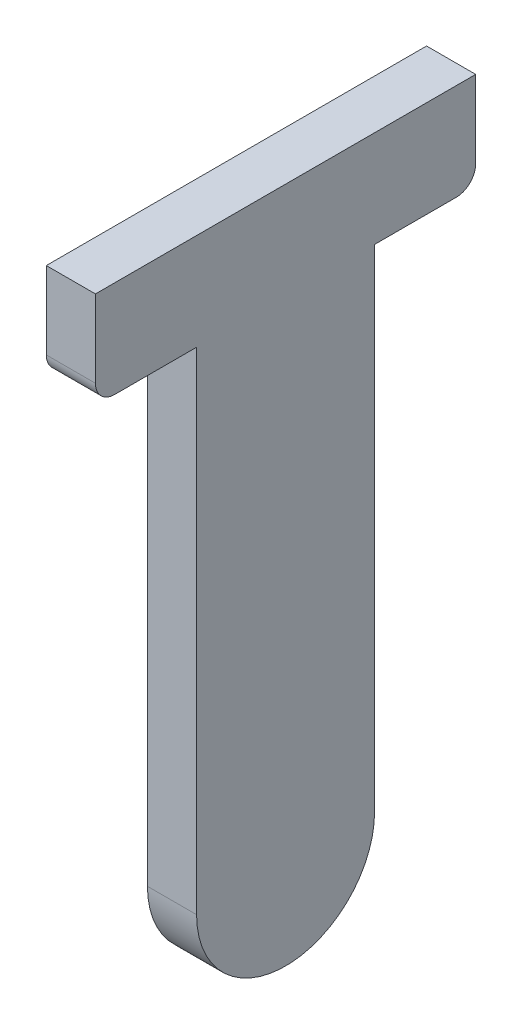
ISO-10303-21;
HEADER;
FILE_DESCRIPTION(('STEP AP214'),'2;1');
FILE_NAME('part.step','',(''),(''),'','','');
FILE_SCHEMA(('AUTOMOTIVE_DESIGN { 1 0 10303 214 1 1 1 1 }'));
ENDSEC;
DATA;
#1=APPLICATION_CONTEXT('core data for automotive mechanical design processes');
#2=APPLICATION_PROTOCOL_DEFINITION('international standard','automotive_design',2000,#1);
#3=PRODUCT_CONTEXT('',#1,'mechanical');
#4=PRODUCT('Part','Part','',(#3));
#5=PRODUCT_RELATED_PRODUCT_CATEGORY('part','',(#4));
#6=PRODUCT_DEFINITION_FORMATION('','',#4);
#7=PRODUCT_DEFINITION_CONTEXT('part definition',#1,'design');
#8=PRODUCT_DEFINITION('design','',#6,#7);
#9=PRODUCT_DEFINITION_SHAPE('','',#8);
#10=(LENGTH_UNIT() NAMED_UNIT(*) SI_UNIT(.MILLI.,.METRE.));
#11=(NAMED_UNIT(*) PLANE_ANGLE_UNIT() SI_UNIT($,.RADIAN.));
#12=(NAMED_UNIT(*) SI_UNIT($,.STERADIAN.) SOLID_ANGLE_UNIT());
#13=UNCERTAINTY_MEASURE_WITH_UNIT(LENGTH_MEASURE(1.E-05),#10,'distance_accuracy_value','');
#14=(GEOMETRIC_REPRESENTATION_CONTEXT(3) GLOBAL_UNCERTAINTY_ASSIGNED_CONTEXT((#13)) GLOBAL_UNIT_ASSIGNED_CONTEXT((#10,
#11,#12)) REPRESENTATION_CONTEXT('',''));
#15=CARTESIAN_POINT('',(0.,0.,0.));
#16=DIRECTION('',(0.,0.,1.));
#17=DIRECTION('',(1.,0.,0.));
#18=AXIS2_PLACEMENT_3D('',#15,#16,#17);
#19=CARTESIAN_POINT('',(-6.996,-9.21,0.));
#20=DIRECTION('',(1.,0.,0.));
#21=DIRECTION('',(0.,0.,-1.));
#22=AXIS2_PLACEMENT_3D('',#19,#20,#21);
#23=PLANE('',#22);
#24=CARTESIAN_POINT('',(-6.996,-9.61,-22.38274));
#25=DIRECTION('',(1.,0.,0.));
#26=DIRECTION('',(0.,0.,-1.));
#27=AXIS2_PLACEMENT_3D('',#24,#25,#26);
#28=CIRCLE('',#27,0.1);
#29=CARTESIAN_POINT('',(-6.996,-9.61,-22.48274));
#30=VERTEX_POINT('',#29);
#31=CARTESIAN_POINT('',(-6.996,-9.71,-22.38274));
#32=VERTEX_POINT('',#31);
#33=EDGE_CURVE('E19',#30,#32,#28,.F.);
#34=ORIENTED_EDGE('',*,*,#33,.F.);
#35=DIRECTION('',(0.,1.,0.));
#36=VECTOR('',#35,1.);
#37=CARTESIAN_POINT('',(-6.996,-9.21,-22.48274));
#38=LINE('',#37,#36);
#39=CARTESIAN_POINT('',(-6.996,-9.21,-22.48274));
#40=VERTEX_POINT('',#39);
#41=EDGE_CURVE('E90',#30,#40,#38,.T.);
#42=ORIENTED_EDGE('',*,*,#41,.T.);
#43=DIRECTION('',(0.,0.,1.));
#44=VECTOR('',#43,1.);
#45=CARTESIAN_POINT('',(-6.996,-9.21,-20.51726));
#46=LINE('',#45,#44);
#47=CARTESIAN_POINT('',(-6.996,-9.21,-20.51726));
#48=VERTEX_POINT('',#47);
#49=EDGE_CURVE('E111',#48,#40,#46,.F.);
#50=ORIENTED_EDGE('',*,*,#49,.F.);
#51=DIRECTION('',(0.,1.,0.));
#52=VECTOR('',#51,1.);
#53=CARTESIAN_POINT('',(-6.996,-9.61,-20.51726));
#54=LINE('',#53,#52);
#55=CARTESIAN_POINT('',(-6.996,-9.61,-20.51726));
#56=VERTEX_POINT('',#55);
#57=EDGE_CURVE('E127',#56,#48,#54,.T.);
#58=ORIENTED_EDGE('',*,*,#57,.F.);
#59=CARTESIAN_POINT('',(-6.996,-9.61,-20.61726));
#60=DIRECTION('',(1.,0.,0.));
#61=DIRECTION('',(0.,0.,-1.));
#62=AXIS2_PLACEMENT_3D('',#59,#60,#61);
#63=CIRCLE('',#62,0.1);
#64=CARTESIAN_POINT('',(-6.996,-9.71,-20.61726));
#65=VERTEX_POINT('',#64);
#66=EDGE_CURVE('E133',#65,#56,#63,.F.);
#67=ORIENTED_EDGE('',*,*,#66,.F.);
#68=DIRECTION('',(0.,0.,-1.));
#69=VECTOR('',#68,1.);
#70=CARTESIAN_POINT('',(-6.996,-9.71,-21.04));
#71=LINE('',#70,#69);
#72=CARTESIAN_POINT('',(-6.996,-9.71,-21.04));
#73=VERTEX_POINT('',#72);
#74=EDGE_CURVE('E137',#73,#65,#71,.F.);
#75=ORIENTED_EDGE('',*,*,#74,.F.);
#76=DIRECTION('',(0.,1.,0.));
#77=VECTOR('',#76,1.);
#78=CARTESIAN_POINT('',(-6.996,-12.25,-21.04));
#79=LINE('',#78,#77);
#80=CARTESIAN_POINT('',(-6.996,-12.25,-21.04));
#81=VERTEX_POINT('',#80);
#82=EDGE_CURVE('E141',#81,#73,#79,.T.);
#83=ORIENTED_EDGE('',*,*,#82,.F.);
#84=CARTESIAN_POINT('',(-6.996,-12.25,-21.5));
#85=DIRECTION('',(1.,0.,0.));
#86=DIRECTION('',(0.,0.,-1.));
#87=AXIS2_PLACEMENT_3D('',#84,#85,#86);
#88=CIRCLE('',#87,0.46);
#89=CARTESIAN_POINT('',(-6.996,-12.25,-21.96));
#90=VERTEX_POINT('',#89);
#91=EDGE_CURVE('E147',#90,#81,#88,.F.);
#92=ORIENTED_EDGE('',*,*,#91,.F.);
#93=DIRECTION('',(0.,1.,0.));
#94=VECTOR('',#93,1.);
#95=CARTESIAN_POINT('',(-6.996,-9.71,-21.96));
#96=LINE('',#95,#94);
#97=CARTESIAN_POINT('',(-6.996,-9.71,-21.96));
#98=VERTEX_POINT('',#97);
#99=EDGE_CURVE('E151',#98,#90,#96,.F.);
#100=ORIENTED_EDGE('',*,*,#99,.F.);
#101=DIRECTION('',(0.,0.,-1.));
#102=VECTOR('',#101,1.);
#103=CARTESIAN_POINT('',(-6.996,-9.71,-22.38274));
#104=LINE('',#103,#102);
#105=EDGE_CURVE('E101',#32,#98,#104,.F.);
#106=ORIENTED_EDGE('',*,*,#105,.F.);
#107=EDGE_LOOP('',(#34,#42,#50,#58,#67,#75,#83,#92,#100,#106));
#108=FACE_BOUND('',#107,.T.);
#109=ADVANCED_FACE('F16',(#108),#23,.T.);
#110=CARTESIAN_POINT('',(-7.25,-9.61,-22.38274));
#111=DIRECTION('',(1.,0.,0.));
#112=DIRECTION('',(0.,0.,-1.));
#113=AXIS2_PLACEMENT_3D('',#110,#111,#112);
#114=CYLINDRICAL_SURFACE('',#113,0.1);
#115=DIRECTION('',(1.,0.,0.));
#116=VECTOR('',#115,1.);
#117=CARTESIAN_POINT('',(-7.25,-9.71,-22.38274));
#118=LINE('',#117,#116);
#119=CARTESIAN_POINT('',(-7.25,-9.71,-22.38274));
#120=VERTEX_POINT('',#119);
#121=EDGE_CURVE('E104',#120,#32,#118,.T.);
#122=ORIENTED_EDGE('',*,*,#121,.F.);
#123=CARTESIAN_POINT('',(-7.25,-9.61,-22.38274));
#124=DIRECTION('',(1.,0.,0.));
#125=DIRECTION('',(0.,0.,-1.));
#126=AXIS2_PLACEMENT_3D('',#123,#124,#125);
#127=CIRCLE('',#126,0.1);
#128=CARTESIAN_POINT('',(-7.25,-9.61,-22.48274));
#129=VERTEX_POINT('',#128);
#130=EDGE_CURVE('E107',#129,#120,#127,.F.);
#131=ORIENTED_EDGE('',*,*,#130,.F.);
#132=DIRECTION('',(-1.,0.,0.));
#133=VECTOR('',#132,1.);
#134=CARTESIAN_POINT('',(-7.25,-9.61,-22.48274));
#135=LINE('',#134,#133);
#136=EDGE_CURVE('E94',#30,#129,#135,.T.);
#137=ORIENTED_EDGE('',*,*,#136,.F.);
#138=ORIENTED_EDGE('',*,*,#33,.T.);
#139=EDGE_LOOP('',(#122,#131,#137,#138));
#140=FACE_BOUND('',#139,.T.);
#141=ADVANCED_FACE('F105',(#140),#114,.T.);
#142=CARTESIAN_POINT('',(-7.25,-9.71,-22.38274));
#143=DIRECTION('',(0.,-1.,0.));
#144=DIRECTION('',(0.,0.,-1.));
#145=AXIS2_PLACEMENT_3D('',#142,#143,#144);
#146=PLANE('',#145);
#147=DIRECTION('',(-1.,0.,0.));
#148=VECTOR('',#147,1.);
#149=CARTESIAN_POINT('',(-7.25,-9.71,-21.96));
#150=LINE('',#149,#148);
#151=CARTESIAN_POINT('',(-7.25,-9.71,-21.96));
#152=VERTEX_POINT('',#151);
#153=EDGE_CURVE('E152',#152,#98,#150,.F.);
#154=ORIENTED_EDGE('',*,*,#153,.F.);
#155=DIRECTION('',(0.,0.,1.));
#156=VECTOR('',#155,1.);
#157=CARTESIAN_POINT('',(-7.25,-9.71,0.));
#158=LINE('',#157,#156);
#159=EDGE_CURVE('E109',#120,#152,#158,.T.);
#160=ORIENTED_EDGE('',*,*,#159,.F.);
#161=ORIENTED_EDGE('',*,*,#121,.T.);
#162=ORIENTED_EDGE('',*,*,#105,.T.);
#163=EDGE_LOOP('',(#154,#160,#161,#162));
#164=FACE_BOUND('',#163,.T.);
#165=ADVANCED_FACE('F307',(#164),#146,.T.);
#166=CARTESIAN_POINT('',(-7.25,-9.71,-21.96));
#167=DIRECTION('',(0.,0.,-1.));
#168=DIRECTION('',(-1.,0.,0.));
#169=AXIS2_PLACEMENT_3D('',#166,#167,#168);
#170=PLANE('',#169);
#171=DIRECTION('',(1.,0.,0.));
#172=VECTOR('',#171,1.);
#173=CARTESIAN_POINT('',(-7.25,-12.25,-21.96));
#174=LINE('',#173,#172);
#175=CARTESIAN_POINT('',(-7.25,-12.25,-21.96));
#176=VERTEX_POINT('',#175);
#177=EDGE_CURVE('E148',#176,#90,#174,.T.);
#178=ORIENTED_EDGE('',*,*,#177,.F.);
#179=DIRECTION('',(0.,1.,0.));
#180=VECTOR('',#179,1.);
#181=CARTESIAN_POINT('',(-7.25,0.,-21.96));
#182=LINE('',#181,#180);
#183=EDGE_CURVE('E185',#152,#176,#182,.F.);
#184=ORIENTED_EDGE('',*,*,#183,.F.);
#185=ORIENTED_EDGE('',*,*,#153,.T.);
#186=ORIENTED_EDGE('',*,*,#99,.T.);
#187=EDGE_LOOP('',(#178,#184,#185,#186));
#188=FACE_BOUND('',#187,.T.);
#189=ADVANCED_FACE('F298',(#188),#170,.T.);
#190=CARTESIAN_POINT('',(-7.25,-12.25,-21.5));
#191=DIRECTION('',(1.,0.,0.));
#192=DIRECTION('',(0.,0.,-1.));
#193=AXIS2_PLACEMENT_3D('',#190,#191,#192);
#194=CYLINDRICAL_SURFACE('',#193,0.46);
#195=DIRECTION('',(1.,0.,0.));
#196=VECTOR('',#195,1.);
#197=CARTESIAN_POINT('',(-7.25,-12.25,-21.04));
#198=LINE('',#197,#196);
#199=CARTESIAN_POINT('',(-7.25,-12.25,-21.04));
#200=VERTEX_POINT('',#199);
#201=EDGE_CURVE('E144',#200,#81,#198,.T.);
#202=ORIENTED_EDGE('',*,*,#201,.F.);
#203=CARTESIAN_POINT('',(-7.25,-12.25,-21.5));
#204=DIRECTION('',(1.,0.,0.));
#205=DIRECTION('',(0.,0.,-1.));
#206=AXIS2_PLACEMENT_3D('',#203,#204,#205);
#207=CIRCLE('',#206,0.46);
#208=EDGE_CURVE('E182',#176,#200,#207,.F.);
#209=ORIENTED_EDGE('',*,*,#208,.F.);
#210=ORIENTED_EDGE('',*,*,#177,.T.);
#211=ORIENTED_EDGE('',*,*,#91,.T.);
#212=EDGE_LOOP('',(#202,#209,#210,#211));
#213=FACE_BOUND('',#212,.T.);
#214=ADVANCED_FACE('F190',(#213),#194,.T.);
#215=CARTESIAN_POINT('',(-7.25,-12.25,-21.04));
#216=DIRECTION('',(0.,0.,1.));
#217=DIRECTION('',(1.,0.,0.));
#218=AXIS2_PLACEMENT_3D('',#215,#216,#217);
#219=PLANE('',#218);
#220=DIRECTION('',(1.,0.,0.));
#221=VECTOR('',#220,1.);
#222=CARTESIAN_POINT('',(-7.25,-9.71,-21.04));
#223=LINE('',#222,#221);
#224=CARTESIAN_POINT('',(-7.25,-9.71,-21.04));
#225=VERTEX_POINT('',#224);
#226=EDGE_CURVE('E138',#225,#73,#223,.T.);
#227=ORIENTED_EDGE('',*,*,#226,.F.);
#228=DIRECTION('',(0.,1.,0.));
#229=VECTOR('',#228,1.);
#230=CARTESIAN_POINT('',(-7.25,0.,-21.04));
#231=LINE('',#230,#229);
#232=EDGE_CURVE('E184',#200,#225,#231,.T.);
#233=ORIENTED_EDGE('',*,*,#232,.F.);
#234=ORIENTED_EDGE('',*,*,#201,.T.);
#235=ORIENTED_EDGE('',*,*,#82,.T.);
#236=EDGE_LOOP('',(#227,#233,#234,#235));
#237=FACE_BOUND('',#236,.T.);
#238=ADVANCED_FACE('F196',(#237),#219,.T.);
#239=CARTESIAN_POINT('',(-7.25,-9.71,-21.04));
#240=DIRECTION('',(0.,-1.,0.));
#241=DIRECTION('',(0.,0.,-1.));
#242=AXIS2_PLACEMENT_3D('',#239,#240,#241);
#243=PLANE('',#242);
#244=DIRECTION('',(1.,0.,0.));
#245=VECTOR('',#244,1.);
#246=CARTESIAN_POINT('',(-7.25,-9.71,-20.61726));
#247=LINE('',#246,#245);
#248=CARTESIAN_POINT('',(-7.25,-9.71,-20.61726));
#249=VERTEX_POINT('',#248);
#250=EDGE_CURVE('E134',#249,#65,#247,.T.);
#251=ORIENTED_EDGE('',*,*,#250,.F.);
#252=DIRECTION('',(0.,0.,1.));
#253=VECTOR('',#252,1.);
#254=CARTESIAN_POINT('',(-7.25,-9.71,0.));
#255=LINE('',#254,#253);
#256=EDGE_CURVE('E181',#225,#249,#255,.T.);
#257=ORIENTED_EDGE('',*,*,#256,.F.);
#258=ORIENTED_EDGE('',*,*,#226,.T.);
#259=ORIENTED_EDGE('',*,*,#74,.T.);
#260=EDGE_LOOP('',(#251,#257,#258,#259));
#261=FACE_BOUND('',#260,.T.);
#262=ADVANCED_FACE('F271',(#261),#243,.T.);
#263=CARTESIAN_POINT('',(-7.25,-9.61,-20.61726));
#264=DIRECTION('',(1.,0.,0.));
#265=DIRECTION('',(0.,0.,-1.));
#266=AXIS2_PLACEMENT_3D('',#263,#264,#265);
#267=CYLINDRICAL_SURFACE('',#266,0.1);
#268=DIRECTION('',(1.,0.,0.));
#269=VECTOR('',#268,1.);
#270=CARTESIAN_POINT('',(-7.25,-9.61,-20.51726));
#271=LINE('',#270,#269);
#272=CARTESIAN_POINT('',(-7.25,-9.61,-20.51726));
#273=VERTEX_POINT('',#272);
#274=EDGE_CURVE('E130',#273,#56,#271,.T.);
#275=ORIENTED_EDGE('',*,*,#274,.F.);
#276=CARTESIAN_POINT('',(-7.25,-9.61,-20.61726));
#277=DIRECTION('',(1.,0.,0.));
#278=DIRECTION('',(0.,0.,-1.));
#279=AXIS2_PLACEMENT_3D('',#276,#277,#278);
#280=CIRCLE('',#279,0.1);
#281=EDGE_CURVE('E178',#249,#273,#280,.F.);
#282=ORIENTED_EDGE('',*,*,#281,.F.);
#283=ORIENTED_EDGE('',*,*,#250,.T.);
#284=ORIENTED_EDGE('',*,*,#66,.T.);
#285=EDGE_LOOP('',(#275,#282,#283,#284));
#286=FACE_BOUND('',#285,.T.);
#287=ADVANCED_FACE('F236',(#286),#267,.T.);
#288=CARTESIAN_POINT('',(-7.25,-9.61,-20.51726));
#289=DIRECTION('',(0.,0.,1.));
#290=DIRECTION('',(1.,0.,0.));
#291=AXIS2_PLACEMENT_3D('',#288,#289,#290);
#292=PLANE('',#291);
#293=DIRECTION('',(1.,0.,0.));
#294=VECTOR('',#293,1.);
#295=CARTESIAN_POINT('',(-7.25,-9.21,-20.51726));
#296=LINE('',#295,#294);
#297=CARTESIAN_POINT('',(-7.25,-9.21,-20.51726));
#298=VERTEX_POINT('',#297);
#299=EDGE_CURVE('E124',#298,#48,#296,.T.);
#300=ORIENTED_EDGE('',*,*,#299,.F.);
#301=DIRECTION('',(0.,1.,0.));
#302=VECTOR('',#301,1.);
#303=CARTESIAN_POINT('',(-7.25,0.,-20.51726));
#304=LINE('',#303,#302);
#305=EDGE_CURVE('E121',#273,#298,#304,.T.);
#306=ORIENTED_EDGE('',*,*,#305,.F.);
#307=ORIENTED_EDGE('',*,*,#274,.T.);
#308=ORIENTED_EDGE('',*,*,#57,.T.);
#309=EDGE_LOOP('',(#300,#306,#307,#308));
#310=FACE_BOUND('',#309,.T.);
#311=ADVANCED_FACE('F225',(#310),#292,.T.);
#312=CARTESIAN_POINT('',(-7.25,-9.21,-20.51726));
#313=DIRECTION('',(0.,1.,0.));
#314=DIRECTION('',(0.,0.,1.));
#315=AXIS2_PLACEMENT_3D('',#312,#313,#314);
#316=PLANE('',#315);
#317=DIRECTION('',(-1.,0.,0.));
#318=VECTOR('',#317,1.);
#319=CARTESIAN_POINT('',(-7.25,-9.21,-22.48274));
#320=LINE('',#319,#318);
#321=CARTESIAN_POINT('',(-7.25,-9.21,-22.48274));
#322=VERTEX_POINT('',#321);
#323=EDGE_CURVE('E34',#322,#40,#320,.F.);
#324=ORIENTED_EDGE('',*,*,#323,.F.);
#325=DIRECTION('',(0.,0.,1.));
#326=VECTOR('',#325,1.);
#327=CARTESIAN_POINT('',(-7.25,-9.21,0.));
#328=LINE('',#327,#326);
#329=EDGE_CURVE('E25',#298,#322,#328,.F.);
#330=ORIENTED_EDGE('',*,*,#329,.F.);
#331=ORIENTED_EDGE('',*,*,#299,.T.);
#332=ORIENTED_EDGE('',*,*,#49,.T.);
#333=EDGE_LOOP('',(#324,#330,#331,#332));
#334=FACE_BOUND('',#333,.T.);
#335=ADVANCED_FACE('F227',(#334),#316,.T.);
#336=CARTESIAN_POINT('',(-7.25,-9.21,-22.48274));
#337=DIRECTION('',(0.,0.,-1.));
#338=DIRECTION('',(-1.,0.,0.));
#339=AXIS2_PLACEMENT_3D('',#336,#337,#338);
#340=PLANE('',#339);
#341=ORIENTED_EDGE('',*,*,#136,.T.);
#342=DIRECTION('',(0.,1.,0.));
#343=VECTOR('',#342,1.);
#344=CARTESIAN_POINT('',(-7.25,0.,-22.48274));
#345=LINE('',#344,#343);
#346=EDGE_CURVE('E10',#322,#129,#345,.F.);
#347=ORIENTED_EDGE('',*,*,#346,.F.);
#348=ORIENTED_EDGE('',*,*,#323,.T.);
#349=ORIENTED_EDGE('',*,*,#41,.F.);
#350=EDGE_LOOP('',(#341,#347,#348,#349));
#351=FACE_BOUND('',#350,.T.);
#352=ADVANCED_FACE('F92',(#351),#340,.T.);
#353=CARTESIAN_POINT('',(-7.25,0.,0.));
#354=DIRECTION('',(-1.,0.,0.));
#355=DIRECTION('',(0.,0.,1.));
#356=AXIS2_PLACEMENT_3D('',#353,#354,#355);
#357=PLANE('',#356);
#358=ORIENTED_EDGE('',*,*,#329,.T.);
#359=ORIENTED_EDGE('',*,*,#346,.T.);
#360=ORIENTED_EDGE('',*,*,#130,.T.);
#361=ORIENTED_EDGE('',*,*,#159,.T.);
#362=ORIENTED_EDGE('',*,*,#183,.T.);
#363=ORIENTED_EDGE('',*,*,#208,.T.);
#364=ORIENTED_EDGE('',*,*,#232,.T.);
#365=ORIENTED_EDGE('',*,*,#256,.T.);
#366=ORIENTED_EDGE('',*,*,#281,.T.);
#367=ORIENTED_EDGE('',*,*,#305,.T.);
#368=EDGE_LOOP('',(#358,#359,#360,#361,#362,#363,#364,#365,#366,#367));
#369=FACE_BOUND('',#368,.T.);
#370=ADVANCED_FACE('F203',(#369),#357,.T.);
#371=CLOSED_SHELL('',(#109,#141,#165,#189,#214,#238,#262,#287,#311,#335,#352,#370));
#372=MANIFOLD_SOLID_BREP('B1',#371);
#373=ADVANCED_BREP_SHAPE_REPRESENTATION('',(#18,#372),#14);
#374=SHAPE_DEFINITION_REPRESENTATION(#9,#373);
ENDSEC;
END-ISO-10303-21;
